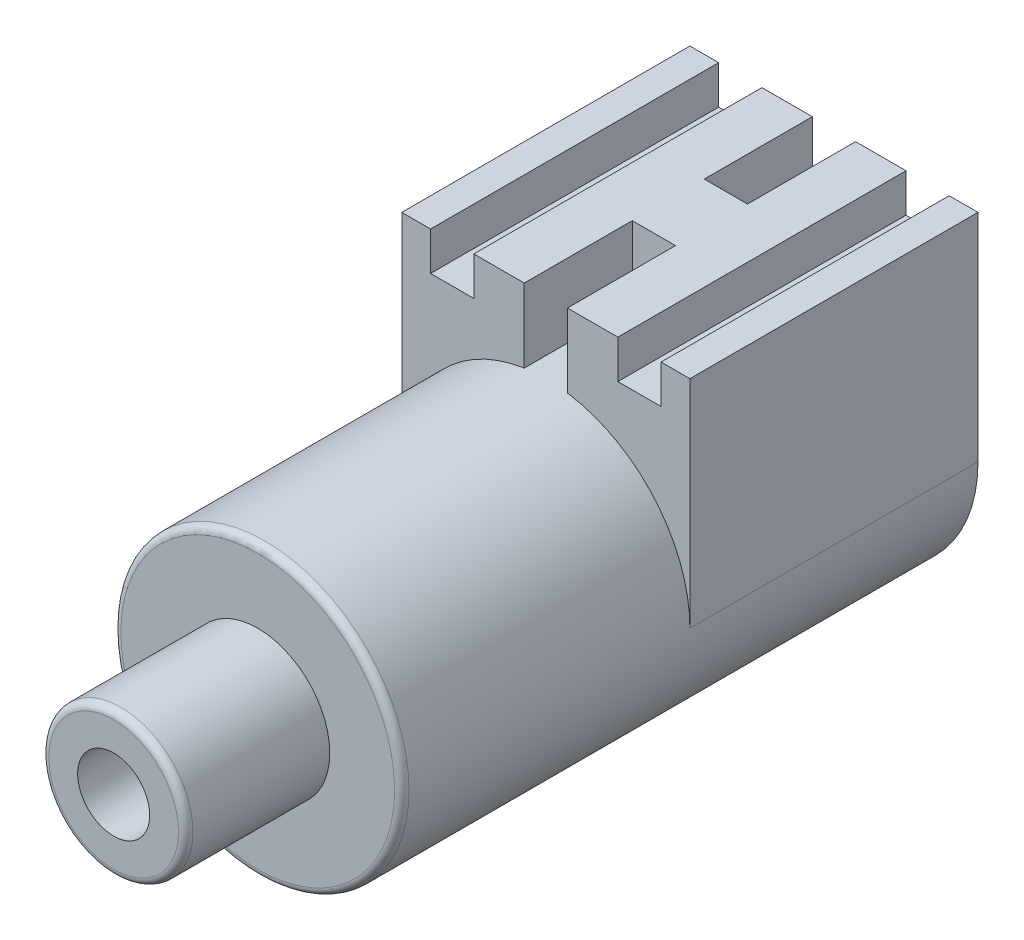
from build123d import *
from build123d.topology import SkipClean

# Parameters (mm, degrees)
ESQUISSE1_R             = 1
EXTRUSION1_DEPTH        = 2
ESQUISSE2_R             = 2
EXTRUSION2_DEPTH        = 8
ESQUISSE3_R             = 0.5
ENL_V_MAT_EXTRU_1_DEPTH = 11.392304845
EXTRUSION4_START        = -4
EXTRUSION4_DEPTH        = 4
CONG_1_R                = 0.1
ESQUISSE5_W             = 0.6
ESQUISSE5_H             = 0.534799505
ENL_V_MAT_EXTRU_2_DEPTH = 11.630145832
ENL_V_START             = -1.5
ENL_V_MAT_EXTRU_3_DEPTH = 1.5
ENL_V_MAT_EXTRU_4_DEPTH = 1.5


with BuildPart() as part:
    # Esquisse1 → Extrusion1 (new body)
    with BuildSketch(Plane.XY):
        Circle(ESQUISSE1_R)
    extrude(amount=-EXTRUSION1_DEPTH)

    # Esquisse2 → Extrusion2 (add)
    with BuildSketch(Plane(origin=(0, 0, -2), x_dir=(-1, 0, 0), z_dir=(0, 0, -1))):
        Circle(ESQUISSE2_R)
    extrude(amount=EXTRUSION2_DEPTH)

    # Esquisse3 → Enl_v. mat.-Extru.1 (cut, through all)
    with BuildSketch(Plane.XY):
        Circle(ESQUISSE3_R)
    extrude(amount=-ENL_V_MAT_EXTRU_1_DEPTH, mode=Mode.SUBTRACT)

    # Esquisse4 → Extrusion4 (add)
    with BuildSketch(Plane(origin=(0, 0, -10), x_dir=(-1, 0, 0), z_dir=(0, 0, -1)).offset(EXTRUSION4_START)):
        with BuildLine():
            Line((-2, 3), (2, 3))
            Line((2, 3), (2, 0))
            ThreePointArc((2, 0), (0, -2), (-2, 0))
            Line((-2, 0), (-2, 3))
        make_face()
    extrude(amount=EXTRUSION4_DEPTH)

    # Cong_1
    cong_1_edges = [part.edges().sort_by_distance(p)[0] for p in [
        (-1, 0, 0),
        (2, 0, -2),
    ]]
    fillet(cong_1_edges, radius=CONG_1_R)

    # Esquisse5 → Enl_v. mat.-Extru.2 (cut, through all)
    with BuildSketch(Plane(origin=(0, 0, -10), x_dir=(-1, 0, 0), z_dir=(0, 0, -1))):
        with Locations((-1.3, 2.732600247)):
            Rectangle(ESQUISSE5_W, ESQUISSE5_H)
        with Locations((1.3, 2.732600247)):
            Rectangle(ESQUISSE5_W, ESQUISSE5_H)
    extrude(amount=-ENL_V_MAT_EXTRU_2_DEPTH, mode=Mode.SUBTRACT)

    # Esquisse6 → Enl_v. mat.-Extru.3 (cut)
    with BuildSketch(Plane(origin=(0, 0, -10), x_dir=(-1, 0, 0), z_dir=(0, 0, -1)).offset(ENL_V_START)):
        with BuildLine():
            Line((-0.3, 3), (0.3, 3))
            Line((0.3, 3), (0.3, 1.977371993))
            ThreePointArc((0.3, 1.977371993), (0, 2), (-0.3, 1.977371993))
            Line((-0.3, 1.977371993), (-0.3, 3))
        make_face()
    extrude(amount=ENL_V_MAT_EXTRU_3_DEPTH, mode=Mode.SUBTRACT)

    # Esquisse7 → Enl_v. mat.-Extru.4 (cut)
    with SkipClean():  # the faces are left unmerged after this step: merging them gives an invalid solid
        with BuildSketch(Plane.XY.offset(-6)):
            with BuildLine():
                Line((-0.3, 3), (0.3, 3))
                Line((0.3, 3), (0.3, 1.977371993))
                ThreePointArc((0.3, 1.977371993), (0, 2), (-0.3, 1.977371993))
                Line((-0.3, 1.977371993), (-0.3, 3))
            make_face()
        extrude(amount=-ENL_V_MAT_EXTRU_4_DEPTH, mode=Mode.SUBTRACT)


solid = part.part
